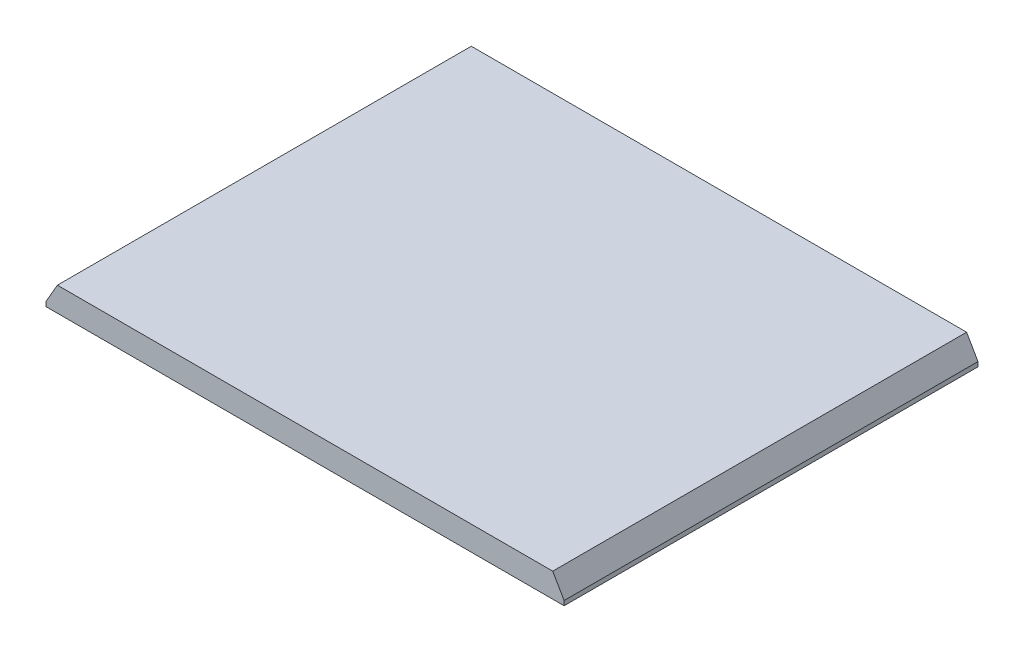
from build123d import *
from OCP.BRepFilletAPI import BRepFilletAPI_MakeChamfer

# Parameters (mm, degrees)
SKETCH3_W           = 1083.083
SKETCH3_H           = 865.2
BOSS_EXTRUDE1_DEPTH = 50.8
CHAMFER1_SIZE       = 41.275
CHAMFER1_SIZE2      = 23.830132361


with BuildPart() as part:
    # Sketch3 → Boss-Extrude1 (new body)
    with BuildSketch(Plane(origin=(0, 0, 0), x_dir=(-1, 0, 0), z_dir=(0, 1, 0))):
        Rectangle(SKETCH3_W, SKETCH3_H)
    extrude(amount=BOSS_EXTRUDE1_DEPTH)

    # Chamfer1: one chamfer whose edges measure the first distance from different faces: ONE call of the kernel's chamfer builder (chamfer() names one face for all edges)
    chamfer1_edges_1 = [part.edges().sort_by_distance(p)[0] for p in [
        (-541.5415, 50.8, 0),
    ]]
    chamfer1_side_1 = [part.faces().sort_by_distance(p)[0] for p in [
        (-541.5415, 25.4, 0),
    ]]
    chamfer1_edges_2 = [part.edges().sort_by_distance(p)[0] for p in [
        (541.5415, 50.8, 0),
    ]]
    chamfer1_side_2 = [part.faces().sort_by_distance(p)[0] for p in [
        (541.5415, 25.4, 0),
    ]]
    chamfer1 = BRepFilletAPI_MakeChamfer(part.part.solid().wrapped)
    for e in chamfer1_edges_1:
        chamfer1.Add(CHAMFER1_SIZE, CHAMFER1_SIZE2, e.wrapped, chamfer1_side_1[0].wrapped)  # the first distance lies on this face
    for e in chamfer1_edges_2:
        chamfer1.Add(CHAMFER1_SIZE, CHAMFER1_SIZE2, e.wrapped, chamfer1_side_2[0].wrapped)  # the first distance lies on this face
    add(Compound.cast(chamfer1.Shape()), mode=Mode.REPLACE)


solid = part.part
